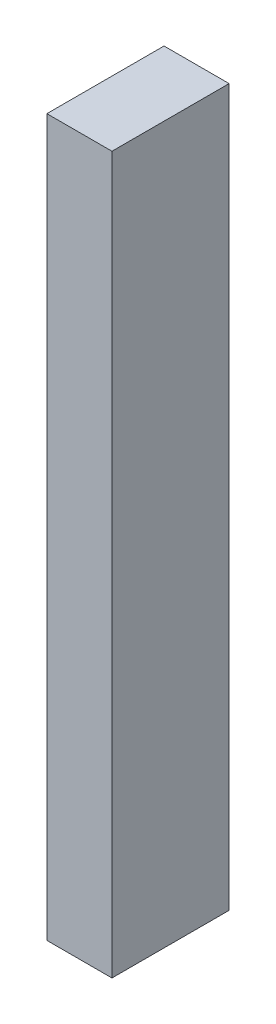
ISO-10303-21;
HEADER;
FILE_DESCRIPTION(('STEP AP214'),'2;1');
FILE_NAME('part.step','',(''),(''),'','','');
FILE_SCHEMA(('AUTOMOTIVE_DESIGN { 1 0 10303 214 1 1 1 1 }'));
ENDSEC;
DATA;
#1=APPLICATION_CONTEXT('core data for automotive mechanical design processes');
#2=APPLICATION_PROTOCOL_DEFINITION('international standard','automotive_design',2000,#1);
#3=PRODUCT_CONTEXT('',#1,'mechanical');
#4=PRODUCT('Part','Part','',(#3));
#5=PRODUCT_RELATED_PRODUCT_CATEGORY('part','',(#4));
#6=PRODUCT_DEFINITION_FORMATION('','',#4);
#7=PRODUCT_DEFINITION_CONTEXT('part definition',#1,'design');
#8=PRODUCT_DEFINITION('design','',#6,#7);
#9=PRODUCT_DEFINITION_SHAPE('','',#8);
#10=(LENGTH_UNIT() NAMED_UNIT(*) SI_UNIT(.MILLI.,.METRE.));
#11=(NAMED_UNIT(*) PLANE_ANGLE_UNIT() SI_UNIT($,.RADIAN.));
#12=(NAMED_UNIT(*) SI_UNIT($,.STERADIAN.) SOLID_ANGLE_UNIT());
#13=UNCERTAINTY_MEASURE_WITH_UNIT(LENGTH_MEASURE(1.E-05),#10,'distance_accuracy_value','');
#14=(GEOMETRIC_REPRESENTATION_CONTEXT(3) GLOBAL_UNCERTAINTY_ASSIGNED_CONTEXT((#13)) GLOBAL_UNIT_ASSIGNED_CONTEXT((#10,
#11,#12)) REPRESENTATION_CONTEXT('',''));
#15=CARTESIAN_POINT('',(0.,0.,0.));
#16=DIRECTION('',(0.,0.,1.));
#17=DIRECTION('',(1.,0.,0.));
#18=AXIS2_PLACEMENT_3D('',#15,#16,#17);
#19=CARTESIAN_POINT('',(0.,0.,-18.));
#20=DIRECTION('',(-1.,0.,0.));
#21=DIRECTION('',(0.,0.,1.));
#22=AXIS2_PLACEMENT_3D('',#19,#20,#21);
#23=PLANE('',#22);
#24=DIRECTION('',(0.,-1.,0.));
#25=VECTOR('',#24,1.);
#26=CARTESIAN_POINT('',(0.,0.,0.));
#27=LINE('',#26,#25);
#28=CARTESIAN_POINT('',(0.,110.,0.));
#29=VERTEX_POINT('',#28);
#30=CARTESIAN_POINT('',(0.,0.,0.));
#31=VERTEX_POINT('',#30);
#32=EDGE_CURVE('E66',#29,#31,#27,.T.);
#33=ORIENTED_EDGE('',*,*,#32,.F.);
#34=DIRECTION('',(0.,0.,1.));
#35=VECTOR('',#34,1.);
#36=CARTESIAN_POINT('',(0.,110.,-18.));
#37=LINE('',#36,#35);
#38=CARTESIAN_POINT('',(0.,110.,-18.));
#39=VERTEX_POINT('',#38);
#40=EDGE_CURVE('E11',#39,#29,#37,.T.);
#41=ORIENTED_EDGE('',*,*,#40,.F.);
#42=DIRECTION('',(0.,-1.,0.));
#43=VECTOR('',#42,1.);
#44=CARTESIAN_POINT('',(0.,0.,-18.));
#45=LINE('',#44,#43);
#46=CARTESIAN_POINT('',(0.,0.,-18.));
#47=VERTEX_POINT('',#46);
#48=EDGE_CURVE('E68',#39,#47,#45,.T.);
#49=ORIENTED_EDGE('',*,*,#48,.T.);
#50=DIRECTION('',(0.,0.,1.));
#51=VECTOR('',#50,1.);
#52=CARTESIAN_POINT('',(0.,0.,-18.));
#53=LINE('',#52,#51);
#54=EDGE_CURVE('E29',#47,#31,#53,.T.);
#55=ORIENTED_EDGE('',*,*,#54,.T.);
#56=EDGE_LOOP('',(#33,#41,#49,#55));
#57=FACE_BOUND('',#56,.T.);
#58=ADVANCED_FACE('F26',(#57),#23,.T.);
#59=CARTESIAN_POINT('',(0.,110.,-18.));
#60=DIRECTION('',(0.,1.,0.));
#61=DIRECTION('',(0.,0.,1.));
#62=AXIS2_PLACEMENT_3D('',#59,#60,#61);
#63=PLANE('',#62);
#64=DIRECTION('',(-1.,0.,0.));
#65=VECTOR('',#64,1.);
#66=CARTESIAN_POINT('',(0.,110.,0.));
#67=LINE('',#66,#65);
#68=CARTESIAN_POINT('',(10.,110.,0.));
#69=VERTEX_POINT('',#68);
#70=EDGE_CURVE('E83',#69,#29,#67,.T.);
#71=ORIENTED_EDGE('',*,*,#70,.F.);
#72=DIRECTION('',(0.,0.,1.));
#73=VECTOR('',#72,1.);
#74=CARTESIAN_POINT('',(10.,110.,-18.));
#75=LINE('',#74,#73);
#76=CARTESIAN_POINT('',(10.,110.,-18.));
#77=VERTEX_POINT('',#76);
#78=EDGE_CURVE('E34',#77,#69,#75,.T.);
#79=ORIENTED_EDGE('',*,*,#78,.F.);
#80=DIRECTION('',(-1.,0.,0.));
#81=VECTOR('',#80,1.);
#82=CARTESIAN_POINT('',(0.,110.,-18.));
#83=LINE('',#82,#81);
#84=EDGE_CURVE('E73',#77,#39,#83,.T.);
#85=ORIENTED_EDGE('',*,*,#84,.T.);
#86=ORIENTED_EDGE('',*,*,#40,.T.);
#87=EDGE_LOOP('',(#71,#79,#85,#86));
#88=FACE_BOUND('',#87,.T.);
#89=ADVANCED_FACE('F98',(#88),#63,.T.);
#90=CARTESIAN_POINT('',(10.,0.,-18.));
#91=DIRECTION('',(1.,0.,0.));
#92=DIRECTION('',(0.,0.,-1.));
#93=AXIS2_PLACEMENT_3D('',#90,#91,#92);
#94=PLANE('',#93);
#95=DIRECTION('',(0.,1.,0.));
#96=VECTOR('',#95,1.);
#97=CARTESIAN_POINT('',(10.,0.,0.));
#98=LINE('',#97,#96);
#99=CARTESIAN_POINT('',(10.,0.,0.));
#100=VERTEX_POINT('',#99);
#101=EDGE_CURVE('E80',#100,#69,#98,.T.);
#102=ORIENTED_EDGE('',*,*,#101,.F.);
#103=DIRECTION('',(0.,0.,1.));
#104=VECTOR('',#103,1.);
#105=CARTESIAN_POINT('',(10.,0.,-18.));
#106=LINE('',#105,#104);
#107=CARTESIAN_POINT('',(10.,0.,-18.));
#108=VERTEX_POINT('',#107);
#109=EDGE_CURVE('E72',#108,#100,#106,.T.);
#110=ORIENTED_EDGE('',*,*,#109,.F.);
#111=DIRECTION('',(0.,1.,0.));
#112=VECTOR('',#111,1.);
#113=CARTESIAN_POINT('',(10.,0.,-18.));
#114=LINE('',#113,#112);
#115=EDGE_CURVE('E91',#108,#77,#114,.T.);
#116=ORIENTED_EDGE('',*,*,#115,.T.);
#117=ORIENTED_EDGE('',*,*,#78,.T.);
#118=EDGE_LOOP('',(#102,#110,#116,#117));
#119=FACE_BOUND('',#118,.T.);
#120=ADVANCED_FACE('F95',(#119),#94,.T.);
#121=CARTESIAN_POINT('',(0.,0.,-18.));
#122=DIRECTION('',(0.,-1.,0.));
#123=DIRECTION('',(0.,0.,-1.));
#124=AXIS2_PLACEMENT_3D('',#121,#122,#123);
#125=PLANE('',#124);
#126=DIRECTION('',(1.,0.,0.));
#127=VECTOR('',#126,1.);
#128=CARTESIAN_POINT('',(0.,0.,0.));
#129=LINE('',#128,#127);
#130=EDGE_CURVE('E75',#31,#100,#129,.T.);
#131=ORIENTED_EDGE('',*,*,#130,.F.);
#132=ORIENTED_EDGE('',*,*,#54,.F.);
#133=DIRECTION('',(1.,0.,0.));
#134=VECTOR('',#133,1.);
#135=CARTESIAN_POINT('',(0.,0.,-18.));
#136=LINE('',#135,#134);
#137=EDGE_CURVE('E89',#47,#108,#136,.T.);
#138=ORIENTED_EDGE('',*,*,#137,.T.);
#139=ORIENTED_EDGE('',*,*,#109,.T.);
#140=EDGE_LOOP('',(#131,#132,#138,#139));
#141=FACE_BOUND('',#140,.T.);
#142=ADVANCED_FACE('F76',(#141),#125,.T.);
#143=CARTESIAN_POINT('',(0.,110.,-18.));
#144=DIRECTION('',(0.,0.,-1.));
#145=DIRECTION('',(-1.,0.,0.));
#146=AXIS2_PLACEMENT_3D('',#143,#144,#145);
#147=PLANE('',#146);
#148=ORIENTED_EDGE('',*,*,#48,.F.);
#149=ORIENTED_EDGE('',*,*,#84,.F.);
#150=ORIENTED_EDGE('',*,*,#115,.F.);
#151=ORIENTED_EDGE('',*,*,#137,.F.);
#152=EDGE_LOOP('',(#148,#149,#150,#151));
#153=FACE_BOUND('',#152,.T.);
#154=ADVANCED_FACE('F100',(#153),#147,.T.);
#155=CARTESIAN_POINT('',(0.,110.,0.));
#156=DIRECTION('',(0.,0.,-1.));
#157=DIRECTION('',(-1.,0.,0.));
#158=AXIS2_PLACEMENT_3D('',#155,#156,#157);
#159=PLANE('',#158);
#160=ORIENTED_EDGE('',*,*,#32,.T.);
#161=ORIENTED_EDGE('',*,*,#130,.T.);
#162=ORIENTED_EDGE('',*,*,#101,.T.);
#163=ORIENTED_EDGE('',*,*,#70,.T.);
#164=EDGE_LOOP('',(#160,#161,#162,#163));
#165=FACE_BOUND('',#164,.T.);
#166=ADVANCED_FACE('F82',(#165),#159,.F.);
#167=CLOSED_SHELL('',(#58,#89,#120,#142,#154,#166));
#168=MANIFOLD_SOLID_BREP('B2',#167);
#169=ADVANCED_BREP_SHAPE_REPRESENTATION('',(#18,#168),#14);
#170=SHAPE_DEFINITION_REPRESENTATION(#9,#169);
ENDSEC;
END-ISO-10303-21;
